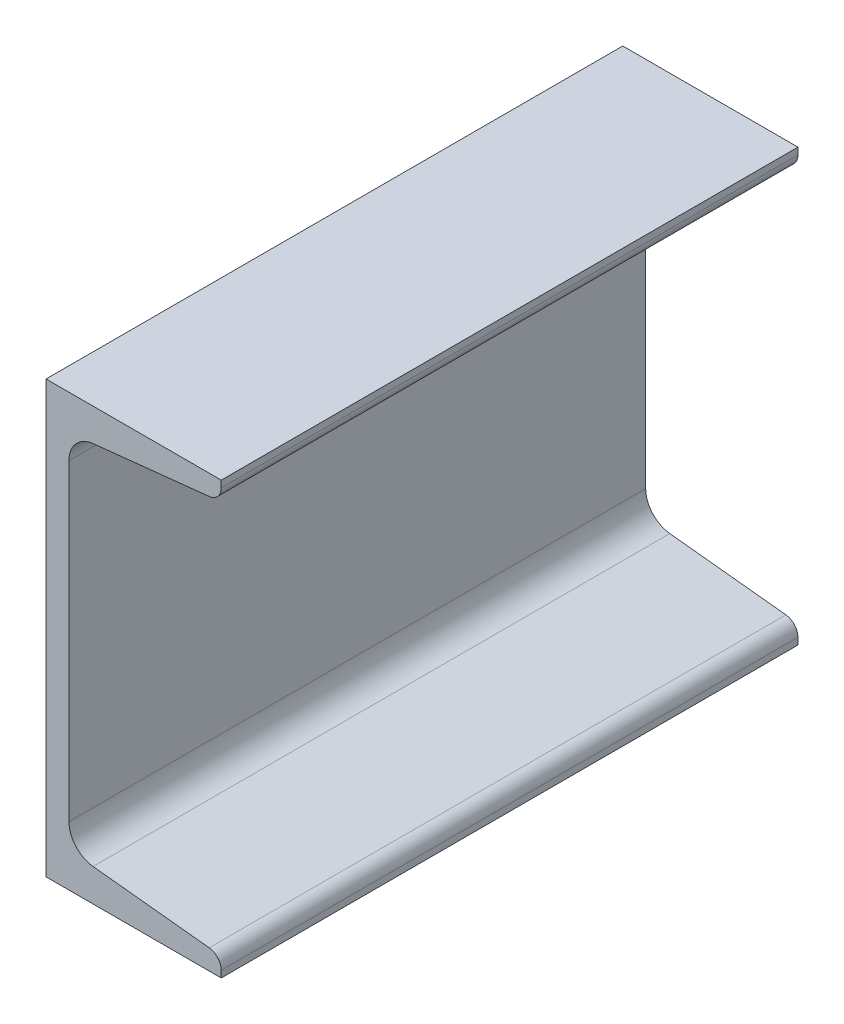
from build123d import *

# Parameters (mm, degrees)
EXTRUDE_1_DEPTH = 214


with BuildPart() as part:
    # Sketch 1 → Extrude 1 (new body)
    with BuildSketch(Plane.XY):
        with BuildLine():
            Line((0, 80), (0, -80))
            Line((0, -80), (65, -80))
            Line((65, -80), (65, -77.497140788))
            ThreePointArc((65, -77.497140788), (63.717527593, -74.153491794), (60.528004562, -72.52509783))
            Line((60.528004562, -72.52509783), (17.443990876, -67.949804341))
            ThreePointArc((17.443990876, -67.949804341), (11.064944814, -64.693016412), (8.5, -58.005718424))
            Line((8.5, -58.005718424), (8.5, 58.005718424))
            ThreePointArc((8.5, 58.005718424), (11.064944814, 64.693016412), (17.443990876, 67.949804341))
            Line((17.443990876, 67.949804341), (60.528004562, 72.52509783))
            ThreePointArc((60.528004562, 72.52509783), (63.717527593, 74.153491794), (65, 77.497140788))
            Line((65, 77.497140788), (65, 80))
            Line((65, 80), (0, 80))
        make_face()
    extrude(amount=EXTRUDE_1_DEPTH)


solid = part.part
